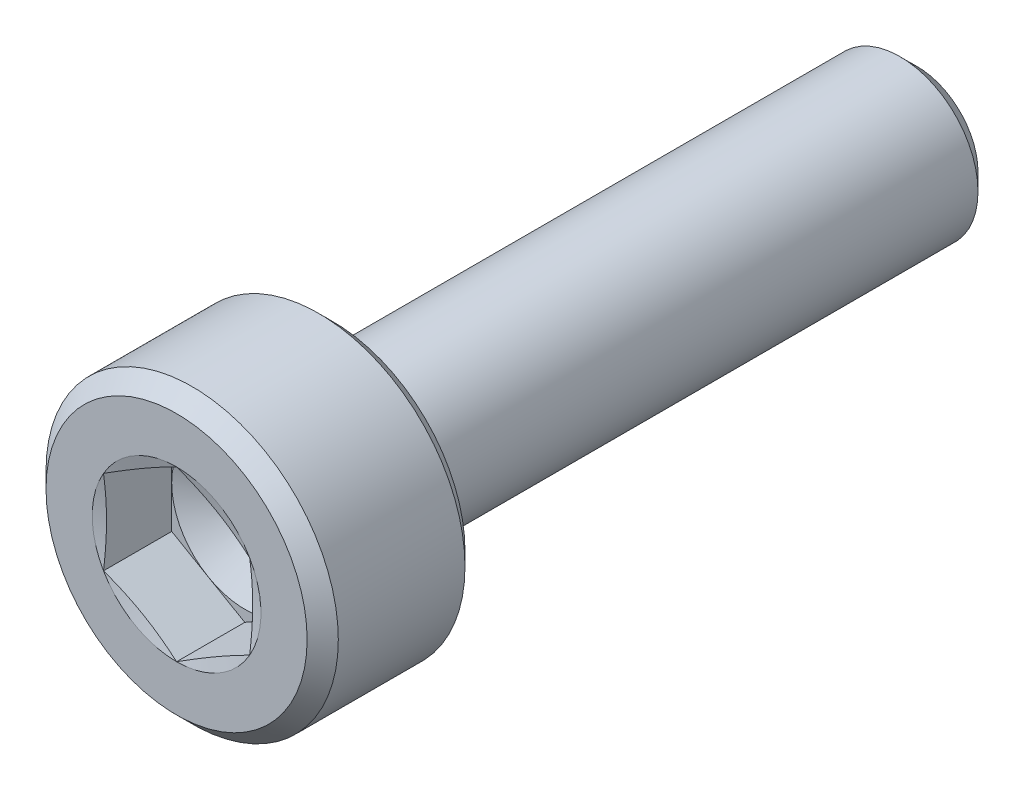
from build123d import *

# Parameters (mm, degrees)
CUT_EXTRUDE1_DEPTH = 0.7


with BuildPart() as part:
    # Sketch1 → Revolve1 (revolve)
    with BuildSketch(Plane(origin=(0, 0, 0), x_dir=(0, 0, -1), z_dir=(1, 0, 0)), mode=Mode.PRIVATE) as revolve1_sk:
        with BuildLine():
            Line((0, 0), (0, 1.34))
            Line((0, 1.34), (0.16, 1.5))
            Line((0.16, 1.5), (1.46, 1.5))
            Line((1.46, 1.5), (1.6, 1.36))
            Line((1.6, 1.36), (1.6, 1))
            ThreePointArc((1.6, 1), (1.616794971, 0.94452998), (1.661538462, 0.907692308))
            Line((1.661538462, 0.907692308), (1.901538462, 0.807692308))
            ThreePointArc((1.901538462, 0.807692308), (1.920388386, 0.801941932), (1.94, 0.8))
            Line((1.94, 0.8), (7.425, 0.8))
            Line((7.425, 0.8), (7.6, 0.625))
            Line((7.6, 0.625), (7.6, 0))
            Line((7.6, 0), (0, 0))
        make_face()
    revolve(revolve1_sk.sketch.rotate(Axis((0, 0, 0), (0, 0, -1)), 90), axis=Axis((0, 0, 0), (0, 0, -1)))

    # Sketch2 → Cut-Extrude1 (cut)
    with BuildSketch(Plane.XY):
        Polygon((0, 0.866025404), (-0.75, 0.433012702), (-0.75, -0.433012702), (0, -0.866025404), (0.75, -0.433012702), (0.75, 0.433012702), align=None)
    extrude(amount=-CUT_EXTRUDE1_DEPTH, mode=Mode.SUBTRACT)

    # Sketch3 → Cut-Revolve2 (revolve, cut)
    with BuildSketch(Plane(origin=(0, 0, 0), x_dir=(0, 0, -1), z_dir=(1, 0, 0)), mode=Mode.PRIVATE) as cut_revolve2_sk:
        Polygon((0.7, 0), (0.7, 0.75), (1.133012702, 0), align=None)
    revolve(cut_revolve2_sk.sketch.rotate(Axis((0, 0, -0.7), (0, 0, -1)), 90), axis=Axis((0, 0, -0.7), (0, 0, -1)), mode=Mode.SUBTRACT)

    # Sketch4 → Cut-Revolve3 (revolve, cut)
    with BuildSketch(Plane(origin=(0, 0, 0), x_dir=(0, 0, -1), z_dir=(1, 0, 0))):
        Polygon((0, 0.866025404), (0, 0.75), (0.031088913, 0.75), align=None)
    revolve(axis=Axis((0, 0, 0), (0, 0, -1)), mode=Mode.SUBTRACT)


solid = part.part
